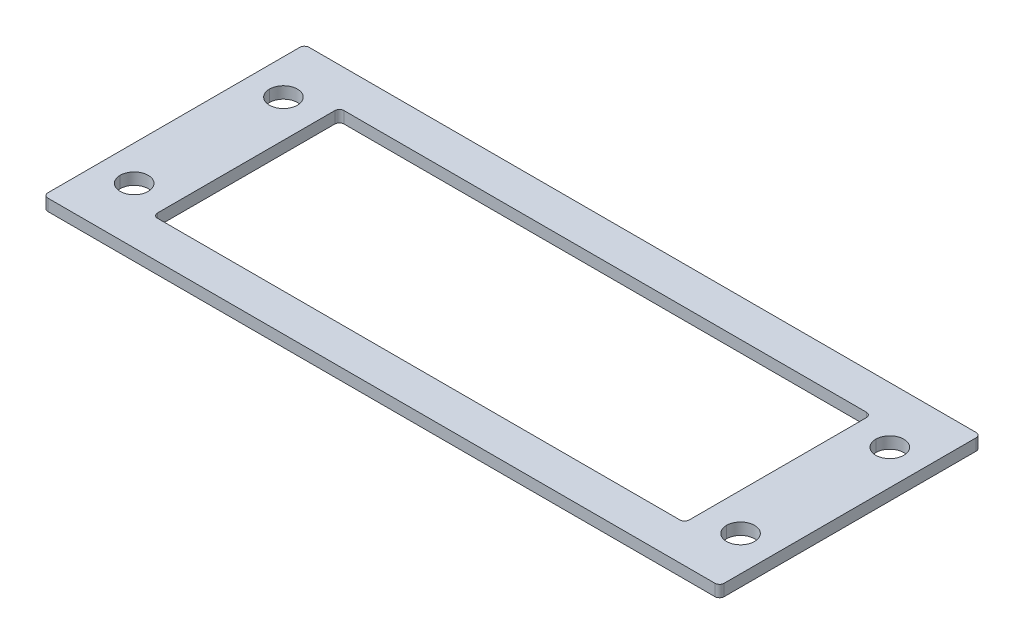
ISO-10303-21;
HEADER;
FILE_DESCRIPTION(('STEP AP214'),'2;1');
FILE_NAME('part.step','',(''),(''),'','','');
FILE_SCHEMA(('AUTOMOTIVE_DESIGN { 1 0 10303 214 1 1 1 1 }'));
ENDSEC;
DATA;
#1=APPLICATION_CONTEXT('core data for automotive mechanical design processes');
#2=APPLICATION_PROTOCOL_DEFINITION('international standard','automotive_design',2000,#1);
#3=PRODUCT_CONTEXT('',#1,'mechanical');
#4=PRODUCT('Part','Part','',(#3));
#5=PRODUCT_RELATED_PRODUCT_CATEGORY('part','',(#4));
#6=PRODUCT_DEFINITION_FORMATION('','',#4);
#7=PRODUCT_DEFINITION_CONTEXT('part definition',#1,'design');
#8=PRODUCT_DEFINITION('design','',#6,#7);
#9=PRODUCT_DEFINITION_SHAPE('','',#8);
#10=(LENGTH_UNIT() NAMED_UNIT(*) SI_UNIT(.MILLI.,.METRE.));
#11=(NAMED_UNIT(*) PLANE_ANGLE_UNIT() SI_UNIT($,.RADIAN.));
#12=(NAMED_UNIT(*) SI_UNIT($,.STERADIAN.) SOLID_ANGLE_UNIT());
#13=UNCERTAINTY_MEASURE_WITH_UNIT(LENGTH_MEASURE(1.E-05),#10,'distance_accuracy_value','');
#14=(GEOMETRIC_REPRESENTATION_CONTEXT(3) GLOBAL_UNCERTAINTY_ASSIGNED_CONTEXT((#13)) GLOBAL_UNIT_ASSIGNED_CONTEXT((#10,
#11,#12)) REPRESENTATION_CONTEXT('',''));
#15=CARTESIAN_POINT('',(0.,0.,0.));
#16=DIRECTION('',(0.,0.,1.));
#17=DIRECTION('',(1.,0.,0.));
#18=AXIS2_PLACEMENT_3D('',#15,#16,#17);
#19=CARTESIAN_POINT('',(65.,-10.9852813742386,-35.75));
#20=DIRECTION('',(0.,1.,0.));
#21=DIRECTION('',(-1.,0.,0.));
#22=AXIS2_PLACEMENT_3D('',#19,#20,#21);
#23=CYLINDRICAL_SURFACE('',#22,3.);
#24=DIRECTION('',(0.,1.,0.));
#25=VECTOR('',#24,1.);
#26=CARTESIAN_POINT('',(68.,-10.9852813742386,-35.75));
#27=LINE('',#26,#25);
#28=CARTESIAN_POINT('',(68.,-2.5,-35.75));
#29=VERTEX_POINT('',#28);
#30=CARTESIAN_POINT('',(68.,0.,-35.75));
#31=VERTEX_POINT('',#30);
#32=EDGE_CURVE('E240',#29,#31,#27,.T.);
#33=ORIENTED_EDGE('',*,*,#32,.F.);
#34=CARTESIAN_POINT('',(65.,-2.5,-35.75));
#35=DIRECTION('',(0.,1.,0.));
#36=DIRECTION('',(-1.,0.,0.));
#37=AXIS2_PLACEMENT_3D('',#34,#35,#36);
#38=CIRCLE('',#37,3.);
#39=CARTESIAN_POINT('',(62.,-2.5,-35.75));
#40=VERTEX_POINT('',#39);
#41=EDGE_CURVE('E226',#40,#29,#38,.T.);
#42=ORIENTED_EDGE('',*,*,#41,.F.);
#43=DIRECTION('',(0.,1.,0.));
#44=VECTOR('',#43,1.);
#45=CARTESIAN_POINT('',(62.,-10.9852813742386,-35.75));
#46=LINE('',#45,#44);
#47=CARTESIAN_POINT('',(62.,0.,-35.75));
#48=VERTEX_POINT('',#47);
#49=EDGE_CURVE('E249',#40,#48,#46,.T.);
#50=ORIENTED_EDGE('',*,*,#49,.T.);
#51=CARTESIAN_POINT('',(65.,0.,-35.75));
#52=DIRECTION('',(0.,-1.,0.));
#53=DIRECTION('',(1.,0.,0.));
#54=AXIS2_PLACEMENT_3D('',#51,#52,#53);
#55=CIRCLE('',#54,3.);
#56=EDGE_CURVE('E241',#31,#48,#55,.T.);
#57=ORIENTED_EDGE('',*,*,#56,.F.);
#58=EDGE_LOOP('',(#33,#42,#50,#57));
#59=FACE_BOUND('',#58,.T.);
#60=ADVANCED_FACE('F15',(#59),#23,.F.);
#61=CARTESIAN_POINT('',(-65.,-10.9852813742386,-35.75));
#62=DIRECTION('',(0.,1.,0.));
#63=DIRECTION('',(-1.,0.,0.));
#64=AXIS2_PLACEMENT_3D('',#61,#62,#63);
#65=CYLINDRICAL_SURFACE('',#64,3.);
#66=DIRECTION('',(0.,1.,0.));
#67=VECTOR('',#66,1.);
#68=CARTESIAN_POINT('',(-62.,-10.9852813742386,-35.75));
#69=LINE('',#68,#67);
#70=CARTESIAN_POINT('',(-62.,-2.5,-35.75));
#71=VERTEX_POINT('',#70);
#72=CARTESIAN_POINT('',(-62.,0.,-35.75));
#73=VERTEX_POINT('',#72);
#74=EDGE_CURVE('E285',#71,#73,#69,.T.);
#75=ORIENTED_EDGE('',*,*,#74,.F.);
#76=CARTESIAN_POINT('',(-65.,-2.5,-35.75));
#77=DIRECTION('',(0.,1.,0.));
#78=DIRECTION('',(-1.,0.,0.));
#79=AXIS2_PLACEMENT_3D('',#76,#77,#78);
#80=CIRCLE('',#79,3.);
#81=CARTESIAN_POINT('',(-68.,-2.5,-35.75));
#82=VERTEX_POINT('',#81);
#83=EDGE_CURVE('E237',#82,#71,#80,.T.);
#84=ORIENTED_EDGE('',*,*,#83,.F.);
#85=DIRECTION('',(0.,1.,0.));
#86=VECTOR('',#85,1.);
#87=CARTESIAN_POINT('',(-68.,-10.9852813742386,-35.75));
#88=LINE('',#87,#86);
#89=CARTESIAN_POINT('',(-68.,0.,-35.75));
#90=VERTEX_POINT('',#89);
#91=EDGE_CURVE('E303',#82,#90,#88,.T.);
#92=ORIENTED_EDGE('',*,*,#91,.T.);
#93=CARTESIAN_POINT('',(-65.,0.,-35.75));
#94=DIRECTION('',(0.,-1.,0.));
#95=DIRECTION('',(1.,0.,0.));
#96=AXIS2_PLACEMENT_3D('',#93,#94,#95);
#97=CIRCLE('',#96,3.);
#98=EDGE_CURVE('E442',#73,#90,#97,.T.);
#99=ORIENTED_EDGE('',*,*,#98,.F.);
#100=EDGE_LOOP('',(#75,#84,#92,#99));
#101=FACE_BOUND('',#100,.T.);
#102=ADVANCED_FACE('F538',(#101),#65,.F.);
#103=CARTESIAN_POINT('',(71.5,-2.5,-24.75));
#104=DIRECTION('',(0.,1.,0.));
#105=DIRECTION('',(-1.,0.,0.));
#106=AXIS2_PLACEMENT_3D('',#103,#104,#105);
#107=CYLINDRICAL_SURFACE('',#106,1.);
#108=CARTESIAN_POINT('',(71.5,-2.5,-24.75));
#109=DIRECTION('',(0.,-1.,0.));
#110=DIRECTION('',(-1.,0.,0.));
#111=AXIS2_PLACEMENT_3D('',#108,#109,#110);
#112=CIRCLE('',#111,1.);
#113=CARTESIAN_POINT('',(72.5,-2.5,-24.75));
#114=VERTEX_POINT('',#113);
#115=CARTESIAN_POINT('',(71.5,-2.5,-23.75));
#116=VERTEX_POINT('',#115);
#117=EDGE_CURVE('E360',#114,#116,#112,.T.);
#118=ORIENTED_EDGE('',*,*,#117,.F.);
#119=DIRECTION('',(0.,-1.,0.));
#120=VECTOR('',#119,1.);
#121=CARTESIAN_POINT('',(72.5,-2.5,-24.75));
#122=LINE('',#121,#120);
#123=CARTESIAN_POINT('',(72.5,0.,-24.75));
#124=VERTEX_POINT('',#123);
#125=EDGE_CURVE('E268',#124,#114,#122,.T.);
#126=ORIENTED_EDGE('',*,*,#125,.F.);
#127=CARTESIAN_POINT('',(71.5,0.,-24.75));
#128=DIRECTION('',(0.,1.,0.));
#129=DIRECTION('',(-1.,0.,0.));
#130=AXIS2_PLACEMENT_3D('',#127,#128,#129);
#131=CIRCLE('',#130,1.);
#132=CARTESIAN_POINT('',(71.5,0.,-23.75));
#133=VERTEX_POINT('',#132);
#134=EDGE_CURVE('E315',#133,#124,#131,.T.);
#135=ORIENTED_EDGE('',*,*,#134,.F.);
#136=DIRECTION('',(0.,1.,0.));
#137=VECTOR('',#136,1.);
#138=CARTESIAN_POINT('',(71.5,-2.5,-23.75));
#139=LINE('',#138,#137);
#140=EDGE_CURVE('E340',#116,#133,#139,.T.);
#141=ORIENTED_EDGE('',*,*,#140,.F.);
#142=EDGE_LOOP('',(#118,#126,#135,#141));
#143=FACE_BOUND('',#142,.T.);
#144=ADVANCED_FACE('F542',(#143),#107,.T.);
#145=CARTESIAN_POINT('',(71.5,-2.5,-78.75));
#146=DIRECTION('',(0.,1.,0.));
#147=DIRECTION('',(-1.,0.,0.));
#148=AXIS2_PLACEMENT_3D('',#145,#146,#147);
#149=CYLINDRICAL_SURFACE('',#148,1.);
#150=CARTESIAN_POINT('',(71.5,-2.5,-78.75));
#151=DIRECTION('',(0.,-1.,0.));
#152=DIRECTION('',(-1.,0.,0.));
#153=AXIS2_PLACEMENT_3D('',#150,#151,#152);
#154=CIRCLE('',#153,1.);
#155=CARTESIAN_POINT('',(71.5,-2.5,-79.75));
#156=VERTEX_POINT('',#155);
#157=CARTESIAN_POINT('',(72.5,-2.5,-78.75));
#158=VERTEX_POINT('',#157);
#159=EDGE_CURVE('E352',#156,#158,#154,.T.);
#160=ORIENTED_EDGE('',*,*,#159,.F.);
#161=DIRECTION('',(0.,-1.,0.));
#162=VECTOR('',#161,1.);
#163=CARTESIAN_POINT('',(71.5,-2.5,-79.75));
#164=LINE('',#163,#162);
#165=CARTESIAN_POINT('',(71.5,0.,-79.75));
#166=VERTEX_POINT('',#165);
#167=EDGE_CURVE('E269',#166,#156,#164,.T.);
#168=ORIENTED_EDGE('',*,*,#167,.F.);
#169=CARTESIAN_POINT('',(71.5,0.,-78.75));
#170=DIRECTION('',(0.,1.,0.));
#171=DIRECTION('',(-1.,0.,0.));
#172=AXIS2_PLACEMENT_3D('',#169,#170,#171);
#173=CIRCLE('',#172,1.);
#174=CARTESIAN_POINT('',(72.5,0.,-78.75));
#175=VERTEX_POINT('',#174);
#176=EDGE_CURVE('E430',#175,#166,#173,.T.);
#177=ORIENTED_EDGE('',*,*,#176,.F.);
#178=DIRECTION('',(0.,1.,0.));
#179=VECTOR('',#178,1.);
#180=CARTESIAN_POINT('',(72.5,-2.5,-78.75));
#181=LINE('',#180,#179);
#182=EDGE_CURVE('E265',#158,#175,#181,.T.);
#183=ORIENTED_EDGE('',*,*,#182,.F.);
#184=EDGE_LOOP('',(#160,#168,#177,#183));
#185=FACE_BOUND('',#184,.T.);
#186=ADVANCED_FACE('F547',(#185),#149,.T.);
#187=CARTESIAN_POINT('',(-71.5,-2.5,-78.75));
#188=DIRECTION('',(0.,1.,0.));
#189=DIRECTION('',(-1.,0.,0.));
#190=AXIS2_PLACEMENT_3D('',#187,#188,#189);
#191=CYLINDRICAL_SURFACE('',#190,1.);
#192=CARTESIAN_POINT('',(-71.5,-2.5,-78.75));
#193=DIRECTION('',(0.,-1.,0.));
#194=DIRECTION('',(-1.,0.,0.));
#195=AXIS2_PLACEMENT_3D('',#192,#193,#194);
#196=CIRCLE('',#195,1.);
#197=CARTESIAN_POINT('',(-72.5,-2.5,-78.75));
#198=VERTEX_POINT('',#197);
#199=CARTESIAN_POINT('',(-71.5,-2.5,-79.75));
#200=VERTEX_POINT('',#199);
#201=EDGE_CURVE('E344',#198,#200,#196,.T.);
#202=ORIENTED_EDGE('',*,*,#201,.F.);
#203=DIRECTION('',(0.,-1.,0.));
#204=VECTOR('',#203,1.);
#205=CARTESIAN_POINT('',(-72.5,-2.5,-78.75));
#206=LINE('',#205,#204);
#207=CARTESIAN_POINT('',(-72.5,0.,-78.75));
#208=VERTEX_POINT('',#207);
#209=EDGE_CURVE('E482',#208,#198,#206,.T.);
#210=ORIENTED_EDGE('',*,*,#209,.F.);
#211=CARTESIAN_POINT('',(-71.5,0.,-78.75));
#212=DIRECTION('',(0.,1.,0.));
#213=DIRECTION('',(-1.,0.,0.));
#214=AXIS2_PLACEMENT_3D('',#211,#212,#213);
#215=CIRCLE('',#214,1.);
#216=CARTESIAN_POINT('',(-71.5,0.,-79.75));
#217=VERTEX_POINT('',#216);
#218=EDGE_CURVE('E438',#217,#208,#215,.T.);
#219=ORIENTED_EDGE('',*,*,#218,.F.);
#220=DIRECTION('',(0.,1.,0.));
#221=VECTOR('',#220,1.);
#222=CARTESIAN_POINT('',(-71.5,-2.5,-79.75));
#223=LINE('',#222,#221);
#224=EDGE_CURVE('E371',#200,#217,#223,.T.);
#225=ORIENTED_EDGE('',*,*,#224,.F.);
#226=EDGE_LOOP('',(#202,#210,#219,#225));
#227=FACE_BOUND('',#226,.T.);
#228=ADVANCED_FACE('F554',(#227),#191,.T.);
#229=CARTESIAN_POINT('',(-71.5,-2.5,-24.75));
#230=DIRECTION('',(0.,1.,0.));
#231=DIRECTION('',(-1.,0.,0.));
#232=AXIS2_PLACEMENT_3D('',#229,#230,#231);
#233=CYLINDRICAL_SURFACE('',#232,1.);
#234=CARTESIAN_POINT('',(-71.5,-2.5,-24.75));
#235=DIRECTION('',(0.,-1.,0.));
#236=DIRECTION('',(-1.,0.,0.));
#237=AXIS2_PLACEMENT_3D('',#234,#235,#236);
#238=CIRCLE('',#237,1.);
#239=CARTESIAN_POINT('',(-71.5,-2.5,-23.75));
#240=VERTEX_POINT('',#239);
#241=CARTESIAN_POINT('',(-72.5,-2.5,-24.75));
#242=VERTEX_POINT('',#241);
#243=EDGE_CURVE('E332',#240,#242,#238,.T.);
#244=ORIENTED_EDGE('',*,*,#243,.F.);
#245=DIRECTION('',(0.,-1.,0.));
#246=VECTOR('',#245,1.);
#247=CARTESIAN_POINT('',(-71.5,-2.5,-23.75));
#248=LINE('',#247,#246);
#249=CARTESIAN_POINT('',(-71.5,0.,-23.75));
#250=VERTEX_POINT('',#249);
#251=EDGE_CURVE('E337',#250,#240,#248,.T.);
#252=ORIENTED_EDGE('',*,*,#251,.F.);
#253=CARTESIAN_POINT('',(-71.5,0.,-24.75));
#254=DIRECTION('',(0.,1.,0.));
#255=DIRECTION('',(-1.,0.,0.));
#256=AXIS2_PLACEMENT_3D('',#253,#254,#255);
#257=CIRCLE('',#256,1.);
#258=CARTESIAN_POINT('',(-72.5,0.,-24.75));
#259=VERTEX_POINT('',#258);
#260=EDGE_CURVE('E299',#259,#250,#257,.T.);
#261=ORIENTED_EDGE('',*,*,#260,.F.);
#262=DIRECTION('',(0.,1.,0.));
#263=VECTOR('',#262,1.);
#264=CARTESIAN_POINT('',(-72.5,-2.5,-24.75));
#265=LINE('',#264,#263);
#266=EDGE_CURVE('E479',#242,#259,#265,.T.);
#267=ORIENTED_EDGE('',*,*,#266,.F.);
#268=EDGE_LOOP('',(#244,#252,#261,#267));
#269=FACE_BOUND('',#268,.T.);
#270=ADVANCED_FACE('F558',(#269),#233,.T.);
#271=CARTESIAN_POINT('',(-56.,-123.313906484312,-70.75));
#272=DIRECTION('',(0.,-1.,0.));
#273=DIRECTION('',(1.,0.,0.));
#274=AXIS2_PLACEMENT_3D('',#271,#272,#273);
#275=CYLINDRICAL_SURFACE('',#274,1.);
#276=CARTESIAN_POINT('',(-56.,-2.5,-70.75));
#277=DIRECTION('',(0.,1.,0.));
#278=DIRECTION('',(-1.,0.,0.));
#279=AXIS2_PLACEMENT_3D('',#276,#277,#278);
#280=CIRCLE('',#279,1.);
#281=CARTESIAN_POINT('',(-56.,-2.5,-71.75));
#282=VERTEX_POINT('',#281);
#283=CARTESIAN_POINT('',(-57.,-2.5,-70.75));
#284=VERTEX_POINT('',#283);
#285=EDGE_CURVE('E400',#282,#284,#280,.T.);
#286=ORIENTED_EDGE('',*,*,#285,.F.);
#287=DIRECTION('',(0.,-1.,0.));
#288=VECTOR('',#287,1.);
#289=CARTESIAN_POINT('',(-56.,-2.5,-71.75));
#290=LINE('',#289,#288);
#291=CARTESIAN_POINT('',(-56.,0.,-71.75));
#292=VERTEX_POINT('',#291);
#293=EDGE_CURVE('E257',#292,#282,#290,.T.);
#294=ORIENTED_EDGE('',*,*,#293,.F.);
#295=CARTESIAN_POINT('',(-56.,0.,-70.75));
#296=DIRECTION('',(0.,-1.,0.));
#297=DIRECTION('',(-1.,0.,0.));
#298=AXIS2_PLACEMENT_3D('',#295,#296,#297);
#299=CIRCLE('',#298,1.);
#300=CARTESIAN_POINT('',(-57.,0.,-70.75));
#301=VERTEX_POINT('',#300);
#302=EDGE_CURVE('E470',#301,#292,#299,.T.);
#303=ORIENTED_EDGE('',*,*,#302,.F.);
#304=DIRECTION('',(0.,1.,0.));
#305=VECTOR('',#304,1.);
#306=CARTESIAN_POINT('',(-57.,0.,-70.75));
#307=LINE('',#306,#305);
#308=EDGE_CURVE('E10',#284,#301,#307,.T.);
#309=ORIENTED_EDGE('',*,*,#308,.F.);
#310=EDGE_LOOP('',(#286,#294,#303,#309));
#311=FACE_BOUND('',#310,.T.);
#312=ADVANCED_FACE('F503',(#311),#275,.F.);
#313=CARTESIAN_POINT('',(-56.,-123.313906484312,-32.75));
#314=DIRECTION('',(0.,-1.,0.));
#315=DIRECTION('',(1.,0.,0.));
#316=AXIS2_PLACEMENT_3D('',#313,#314,#315);
#317=CYLINDRICAL_SURFACE('',#316,1.);
#318=CARTESIAN_POINT('',(-56.,-2.5,-32.75));
#319=DIRECTION('',(0.,1.,0.));
#320=DIRECTION('',(-1.,0.,0.));
#321=AXIS2_PLACEMENT_3D('',#318,#319,#320);
#322=CIRCLE('',#321,1.);
#323=CARTESIAN_POINT('',(-57.,-2.5,-32.75));
#324=VERTEX_POINT('',#323);
#325=CARTESIAN_POINT('',(-56.,-2.5,-31.75));
#326=VERTEX_POINT('',#325);
#327=EDGE_CURVE('E368',#324,#326,#322,.T.);
#328=ORIENTED_EDGE('',*,*,#327,.F.);
#329=DIRECTION('',(0.,-1.,0.));
#330=VECTOR('',#329,1.);
#331=CARTESIAN_POINT('',(-57.,-2.5,-32.75));
#332=LINE('',#331,#330);
#333=CARTESIAN_POINT('',(-57.,0.,-32.75));
#334=VERTEX_POINT('',#333);
#335=EDGE_CURVE('E23',#334,#324,#332,.T.);
#336=ORIENTED_EDGE('',*,*,#335,.F.);
#337=CARTESIAN_POINT('',(-56.,0.,-32.75));
#338=DIRECTION('',(0.,-1.,0.));
#339=DIRECTION('',(-1.,0.,0.));
#340=AXIS2_PLACEMENT_3D('',#337,#338,#339);
#341=CIRCLE('',#340,1.);
#342=CARTESIAN_POINT('',(-56.,0.,-31.75));
#343=VERTEX_POINT('',#342);
#344=EDGE_CURVE('E462',#343,#334,#341,.T.);
#345=ORIENTED_EDGE('',*,*,#344,.F.);
#346=DIRECTION('',(0.,1.,0.));
#347=VECTOR('',#346,1.);
#348=CARTESIAN_POINT('',(-56.,0.,-31.75));
#349=LINE('',#348,#347);
#350=EDGE_CURVE('E489',#326,#343,#349,.T.);
#351=ORIENTED_EDGE('',*,*,#350,.F.);
#352=EDGE_LOOP('',(#328,#336,#345,#351));
#353=FACE_BOUND('',#352,.T.);
#354=ADVANCED_FACE('F496',(#353),#317,.F.);
#355=CARTESIAN_POINT('',(56.,-123.313906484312,-32.75));
#356=DIRECTION('',(0.,-1.,0.));
#357=DIRECTION('',(1.,0.,0.));
#358=AXIS2_PLACEMENT_3D('',#355,#356,#357);
#359=CYLINDRICAL_SURFACE('',#358,1.);
#360=CARTESIAN_POINT('',(56.,-2.5,-32.75));
#361=DIRECTION('',(0.,1.,0.));
#362=DIRECTION('',(-1.,0.,0.));
#363=AXIS2_PLACEMENT_3D('',#360,#361,#362);
#364=CIRCLE('',#363,1.);
#365=CARTESIAN_POINT('',(56.,-2.5,-31.75));
#366=VERTEX_POINT('',#365);
#367=CARTESIAN_POINT('',(57.,-2.5,-32.75));
#368=VERTEX_POINT('',#367);
#369=EDGE_CURVE('E379',#366,#368,#364,.T.);
#370=ORIENTED_EDGE('',*,*,#369,.F.);
#371=DIRECTION('',(0.,-1.,0.));
#372=VECTOR('',#371,1.);
#373=CARTESIAN_POINT('',(56.,-2.5,-31.75));
#374=LINE('',#373,#372);
#375=CARTESIAN_POINT('',(56.,0.,-31.75));
#376=VERTEX_POINT('',#375);
#377=EDGE_CURVE('E392',#376,#366,#374,.T.);
#378=ORIENTED_EDGE('',*,*,#377,.F.);
#379=CARTESIAN_POINT('',(56.,0.,-32.75));
#380=DIRECTION('',(0.,-1.,0.));
#381=DIRECTION('',(-1.,0.,0.));
#382=AXIS2_PLACEMENT_3D('',#379,#380,#381);
#383=CIRCLE('',#382,1.);
#384=CARTESIAN_POINT('',(57.,0.,-32.75));
#385=VERTEX_POINT('',#384);
#386=EDGE_CURVE('E401',#385,#376,#383,.T.);
#387=ORIENTED_EDGE('',*,*,#386,.F.);
#388=DIRECTION('',(0.,1.,0.));
#389=VECTOR('',#388,1.);
#390=CARTESIAN_POINT('',(57.,0.,-32.75));
#391=LINE('',#390,#389);
#392=EDGE_CURVE('E258',#368,#385,#391,.T.);
#393=ORIENTED_EDGE('',*,*,#392,.F.);
#394=EDGE_LOOP('',(#370,#378,#387,#393));
#395=FACE_BOUND('',#394,.T.);
#396=ADVANCED_FACE('F515',(#395),#359,.F.);
#397=CARTESIAN_POINT('',(56.,-123.313906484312,-70.75));
#398=DIRECTION('',(0.,-1.,0.));
#399=DIRECTION('',(1.,0.,0.));
#400=AXIS2_PLACEMENT_3D('',#397,#398,#399);
#401=CYLINDRICAL_SURFACE('',#400,1.);
#402=CARTESIAN_POINT('',(56.,-2.5,-70.75));
#403=DIRECTION('',(0.,1.,0.));
#404=DIRECTION('',(-1.,0.,0.));
#405=AXIS2_PLACEMENT_3D('',#402,#403,#404);
#406=CIRCLE('',#405,1.);
#407=CARTESIAN_POINT('',(57.,-2.5,-70.75));
#408=VERTEX_POINT('',#407);
#409=CARTESIAN_POINT('',(56.,-2.5,-71.75));
#410=VERTEX_POINT('',#409);
#411=EDGE_CURVE('E389',#408,#410,#406,.T.);
#412=ORIENTED_EDGE('',*,*,#411,.F.);
#413=DIRECTION('',(0.,-1.,0.));
#414=VECTOR('',#413,1.);
#415=CARTESIAN_POINT('',(57.,-2.5,-70.75));
#416=LINE('',#415,#414);
#417=CARTESIAN_POINT('',(57.,0.,-70.75));
#418=VERTEX_POINT('',#417);
#419=EDGE_CURVE('E415',#418,#408,#416,.T.);
#420=ORIENTED_EDGE('',*,*,#419,.F.);
#421=CARTESIAN_POINT('',(56.,0.,-70.75));
#422=DIRECTION('',(0.,-1.,0.));
#423=DIRECTION('',(-1.,0.,0.));
#424=AXIS2_PLACEMENT_3D('',#421,#422,#423);
#425=CIRCLE('',#424,1.);
#426=CARTESIAN_POINT('',(56.,0.,-71.75));
#427=VERTEX_POINT('',#426);
#428=EDGE_CURVE('E452',#427,#418,#425,.T.);
#429=ORIENTED_EDGE('',*,*,#428,.F.);
#430=DIRECTION('',(0.,1.,0.));
#431=VECTOR('',#430,1.);
#432=CARTESIAN_POINT('',(56.,0.,-71.75));
#433=LINE('',#432,#431);
#434=EDGE_CURVE('E254',#410,#427,#433,.T.);
#435=ORIENTED_EDGE('',*,*,#434,.F.);
#436=EDGE_LOOP('',(#412,#420,#429,#435));
#437=FACE_BOUND('',#436,.T.);
#438=ADVANCED_FACE('F522',(#437),#401,.F.);
#439=CARTESIAN_POINT('',(65.,-123.313906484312,-67.75));
#440=DIRECTION('',(0.,1.,0.));
#441=DIRECTION('',(-1.,0.,0.));
#442=AXIS2_PLACEMENT_3D('',#439,#440,#441);
#443=CYLINDRICAL_SURFACE('',#442,3.);
#444=DIRECTION('',(0.,1.,0.));
#445=VECTOR('',#444,1.);
#446=CARTESIAN_POINT('',(68.,-123.313906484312,-67.75));
#447=LINE('',#446,#445);
#448=CARTESIAN_POINT('',(68.,-2.5,-67.75));
#449=VERTEX_POINT('',#448);
#450=CARTESIAN_POINT('',(68.,0.,-67.75));
#451=VERTEX_POINT('',#450);
#452=EDGE_CURVE('E259',#449,#451,#447,.T.);
#453=ORIENTED_EDGE('',*,*,#452,.F.);
#454=CARTESIAN_POINT('',(65.,-2.5,-67.75));
#455=DIRECTION('',(0.,1.,0.));
#456=DIRECTION('',(-1.,0.,0.));
#457=AXIS2_PLACEMENT_3D('',#454,#455,#456);
#458=CIRCLE('',#457,3.);
#459=CARTESIAN_POINT('',(62.,-2.5,-67.75));
#460=VERTEX_POINT('',#459);
#461=EDGE_CURVE('E281',#460,#449,#458,.T.);
#462=ORIENTED_EDGE('',*,*,#461,.F.);
#463=DIRECTION('',(0.,1.,0.));
#464=VECTOR('',#463,1.);
#465=CARTESIAN_POINT('',(62.,-123.313906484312,-67.75));
#466=LINE('',#465,#464);
#467=CARTESIAN_POINT('',(62.,0.,-67.75));
#468=VERTEX_POINT('',#467);
#469=EDGE_CURVE('E275',#460,#468,#466,.T.);
#470=ORIENTED_EDGE('',*,*,#469,.T.);
#471=CARTESIAN_POINT('',(65.,0.,-67.75));
#472=DIRECTION('',(0.,-1.,0.));
#473=DIRECTION('',(1.,0.,0.));
#474=AXIS2_PLACEMENT_3D('',#471,#472,#473);
#475=CIRCLE('',#474,3.);
#476=EDGE_CURVE('E474',#451,#468,#475,.T.);
#477=ORIENTED_EDGE('',*,*,#476,.F.);
#478=EDGE_LOOP('',(#453,#462,#470,#477));
#479=FACE_BOUND('',#478,.T.);
#480=ADVANCED_FACE('F571',(#479),#443,.F.);
#481=CARTESIAN_POINT('',(-65.,-123.313906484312,-67.75));
#482=DIRECTION('',(0.,1.,0.));
#483=DIRECTION('',(-1.,0.,0.));
#484=AXIS2_PLACEMENT_3D('',#481,#482,#483);
#485=CYLINDRICAL_SURFACE('',#484,3.);
#486=DIRECTION('',(0.,1.,0.));
#487=VECTOR('',#486,1.);
#488=CARTESIAN_POINT('',(-62.,-123.313906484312,-67.75));
#489=LINE('',#488,#487);
#490=CARTESIAN_POINT('',(-62.,-2.5,-67.75));
#491=VERTEX_POINT('',#490);
#492=CARTESIAN_POINT('',(-62.,0.,-67.75));
#493=VERTEX_POINT('',#492);
#494=EDGE_CURVE('E290',#491,#493,#489,.T.);
#495=ORIENTED_EDGE('',*,*,#494,.F.);
#496=CARTESIAN_POINT('',(-65.,-2.5,-67.75));
#497=DIRECTION('',(0.,1.,0.));
#498=DIRECTION('',(-1.,0.,0.));
#499=AXIS2_PLACEMENT_3D('',#496,#497,#498);
#500=CIRCLE('',#499,3.);
#501=CARTESIAN_POINT('',(-68.,-2.5,-67.75));
#502=VERTEX_POINT('',#501);
#503=EDGE_CURVE('E410',#502,#491,#500,.T.);
#504=ORIENTED_EDGE('',*,*,#503,.F.);
#505=DIRECTION('',(0.,1.,0.));
#506=VECTOR('',#505,1.);
#507=CARTESIAN_POINT('',(-68.,-123.313906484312,-67.75));
#508=LINE('',#507,#506);
#509=CARTESIAN_POINT('',(-68.,0.,-67.75));
#510=VERTEX_POINT('',#509);
#511=EDGE_CURVE('E307',#502,#510,#508,.T.);
#512=ORIENTED_EDGE('',*,*,#511,.T.);
#513=CARTESIAN_POINT('',(-65.,0.,-67.75));
#514=DIRECTION('',(0.,-1.,0.));
#515=DIRECTION('',(1.,0.,0.));
#516=AXIS2_PLACEMENT_3D('',#513,#514,#515);
#517=CIRCLE('',#516,3.);
#518=EDGE_CURVE('E445',#493,#510,#517,.T.);
#519=ORIENTED_EDGE('',*,*,#518,.F.);
#520=EDGE_LOOP('',(#495,#504,#512,#519));
#521=FACE_BOUND('',#520,.T.);
#522=ADVANCED_FACE('F533',(#521),#485,.F.);
#523=CARTESIAN_POINT('',(-57.,-123.313906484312,-71.75));
#524=DIRECTION('',(1.,0.,0.));
#525=DIRECTION('',(0.,0.,1.));
#526=AXIS2_PLACEMENT_3D('',#523,#524,#525);
#527=PLANE('',#526);
#528=DIRECTION('',(0.,0.,-1.));
#529=VECTOR('',#528,1.);
#530=CARTESIAN_POINT('',(-57.,0.,-71.75));
#531=LINE('',#530,#529);
#532=EDGE_CURVE('E466',#334,#301,#531,.T.);
#533=ORIENTED_EDGE('',*,*,#532,.F.);
#534=ORIENTED_EDGE('',*,*,#335,.T.);
#535=DIRECTION('',(0.,0.,1.));
#536=VECTOR('',#535,1.);
#537=CARTESIAN_POINT('',(-57.,-2.5,-71.75));
#538=LINE('',#537,#536);
#539=EDGE_CURVE('E364',#284,#324,#538,.T.);
#540=ORIENTED_EDGE('',*,*,#539,.F.);
#541=ORIENTED_EDGE('',*,*,#308,.T.);
#542=EDGE_LOOP('',(#533,#534,#540,#541));
#543=FACE_BOUND('',#542,.T.);
#544=ADVANCED_FACE('F495',(#543),#527,.T.);
#545=CARTESIAN_POINT('',(-57.,-123.313906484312,-71.75));
#546=DIRECTION('',(0.,0.,1.));
#547=DIRECTION('',(1.,0.,0.));
#548=AXIS2_PLACEMENT_3D('',#545,#546,#547);
#549=PLANE('',#548);
#550=DIRECTION('',(-1.,0.,0.));
#551=VECTOR('',#550,1.);
#552=CARTESIAN_POINT('',(-57.,-2.5,-71.75));
#553=LINE('',#552,#551);
#554=EDGE_CURVE('E396',#410,#282,#553,.T.);
#555=ORIENTED_EDGE('',*,*,#554,.F.);
#556=ORIENTED_EDGE('',*,*,#434,.T.);
#557=DIRECTION('',(1.,0.,0.));
#558=VECTOR('',#557,1.);
#559=CARTESIAN_POINT('',(-57.,0.,-71.75));
#560=LINE('',#559,#558);
#561=EDGE_CURVE('E448',#292,#427,#560,.T.);
#562=ORIENTED_EDGE('',*,*,#561,.F.);
#563=ORIENTED_EDGE('',*,*,#293,.T.);
#564=EDGE_LOOP('',(#555,#556,#562,#563));
#565=FACE_BOUND('',#564,.T.);
#566=ADVANCED_FACE('F524',(#565),#549,.T.);
#567=CARTESIAN_POINT('',(57.,-123.313906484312,-71.75));
#568=DIRECTION('',(-1.,0.,0.));
#569=DIRECTION('',(0.,-1.,0.));
#570=AXIS2_PLACEMENT_3D('',#567,#568,#569);
#571=PLANE('',#570);
#572=DIRECTION('',(0.,0.,1.));
#573=VECTOR('',#572,1.);
#574=CARTESIAN_POINT('',(57.,0.,-71.75));
#575=LINE('',#574,#573);
#576=EDGE_CURVE('E406',#418,#385,#575,.T.);
#577=ORIENTED_EDGE('',*,*,#576,.F.);
#578=ORIENTED_EDGE('',*,*,#419,.T.);
#579=DIRECTION('',(0.,0.,-1.));
#580=VECTOR('',#579,1.);
#581=CARTESIAN_POINT('',(57.,-2.5,-71.75));
#582=LINE('',#581,#580);
#583=EDGE_CURVE('E385',#368,#408,#582,.T.);
#584=ORIENTED_EDGE('',*,*,#583,.F.);
#585=ORIENTED_EDGE('',*,*,#392,.T.);
#586=EDGE_LOOP('',(#577,#578,#584,#585));
#587=FACE_BOUND('',#586,.T.);
#588=ADVANCED_FACE('F518',(#587),#571,.T.);
#589=CARTESIAN_POINT('',(-57.,-123.313906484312,-31.75));
#590=DIRECTION('',(0.,0.,-1.));
#591=DIRECTION('',(0.,1.,0.));
#592=AXIS2_PLACEMENT_3D('',#589,#590,#591);
#593=PLANE('',#592);
#594=DIRECTION('',(-1.,0.,0.));
#595=VECTOR('',#594,1.);
#596=CARTESIAN_POINT('',(-57.,0.,-31.75));
#597=LINE('',#596,#595);
#598=EDGE_CURVE('E405',#376,#343,#597,.T.);
#599=ORIENTED_EDGE('',*,*,#598,.F.);
#600=ORIENTED_EDGE('',*,*,#377,.T.);
#601=DIRECTION('',(1.,0.,0.));
#602=VECTOR('',#601,1.);
#603=CARTESIAN_POINT('',(-57.,-2.5,-31.75));
#604=LINE('',#603,#602);
#605=EDGE_CURVE('E375',#326,#366,#604,.T.);
#606=ORIENTED_EDGE('',*,*,#605,.F.);
#607=ORIENTED_EDGE('',*,*,#350,.T.);
#608=EDGE_LOOP('',(#599,#600,#606,#607));
#609=FACE_BOUND('',#608,.T.);
#610=ADVANCED_FACE('F511',(#609),#593,.T.);
#611=CARTESIAN_POINT('',(-72.5,-2.5,-23.75));
#612=DIRECTION('',(0.,0.,-1.));
#613=DIRECTION('',(0.,1.,0.));
#614=AXIS2_PLACEMENT_3D('',#611,#612,#613);
#615=PLANE('',#614);
#616=DIRECTION('',(-1.,0.,0.));
#617=VECTOR('',#616,1.);
#618=CARTESIAN_POINT('',(-72.5,0.,-23.75));
#619=LINE('',#618,#617);
#620=EDGE_CURVE('E311',#133,#250,#619,.T.);
#621=ORIENTED_EDGE('',*,*,#620,.T.);
#622=ORIENTED_EDGE('',*,*,#251,.T.);
#623=DIRECTION('',(-1.,0.,0.));
#624=VECTOR('',#623,1.);
#625=CARTESIAN_POINT('',(-72.5,-2.5,-23.75));
#626=LINE('',#625,#624);
#627=EDGE_CURVE('E328',#116,#240,#626,.T.);
#628=ORIENTED_EDGE('',*,*,#627,.F.);
#629=ORIENTED_EDGE('',*,*,#140,.T.);
#630=EDGE_LOOP('',(#621,#622,#628,#629));
#631=FACE_BOUND('',#630,.T.);
#632=ADVANCED_FACE('F581',(#631),#615,.F.);
#633=CARTESIAN_POINT('',(72.5,-2.5,-79.75));
#634=DIRECTION('',(-1.,0.,0.));
#635=DIRECTION('',(0.,-1.,0.));
#636=AXIS2_PLACEMENT_3D('',#633,#634,#635);
#637=PLANE('',#636);
#638=DIRECTION('',(0.,0.,1.));
#639=VECTOR('',#638,1.);
#640=CARTESIAN_POINT('',(72.5,-2.5,-79.75));
#641=LINE('',#640,#639);
#642=EDGE_CURVE('E356',#158,#114,#641,.T.);
#643=ORIENTED_EDGE('',*,*,#642,.F.);
#644=ORIENTED_EDGE('',*,*,#182,.T.);
#645=DIRECTION('',(0.,0.,1.));
#646=VECTOR('',#645,1.);
#647=CARTESIAN_POINT('',(72.5,0.,-79.75));
#648=LINE('',#647,#646);
#649=EDGE_CURVE('E426',#175,#124,#648,.T.);
#650=ORIENTED_EDGE('',*,*,#649,.T.);
#651=ORIENTED_EDGE('',*,*,#125,.T.);
#652=EDGE_LOOP('',(#643,#644,#650,#651));
#653=FACE_BOUND('',#652,.T.);
#654=ADVANCED_FACE('F579',(#653),#637,.F.);
#655=CARTESIAN_POINT('',(-72.5,-2.5,-79.75));
#656=DIRECTION('',(0.,0.,1.));
#657=DIRECTION('',(1.,0.,0.));
#658=AXIS2_PLACEMENT_3D('',#655,#656,#657);
#659=PLANE('',#658);
#660=DIRECTION('',(1.,0.,0.));
#661=VECTOR('',#660,1.);
#662=CARTESIAN_POINT('',(-72.5,-2.5,-79.75));
#663=LINE('',#662,#661);
#664=EDGE_CURVE('E348',#200,#156,#663,.T.);
#665=ORIENTED_EDGE('',*,*,#664,.F.);
#666=ORIENTED_EDGE('',*,*,#224,.T.);
#667=DIRECTION('',(1.,0.,0.));
#668=VECTOR('',#667,1.);
#669=CARTESIAN_POINT('',(-72.5,0.,-79.75));
#670=LINE('',#669,#668);
#671=EDGE_CURVE('E434',#217,#166,#670,.T.);
#672=ORIENTED_EDGE('',*,*,#671,.T.);
#673=ORIENTED_EDGE('',*,*,#167,.T.);
#674=EDGE_LOOP('',(#665,#666,#672,#673));
#675=FACE_BOUND('',#674,.T.);
#676=ADVANCED_FACE('F575',(#675),#659,.F.);
#677=CARTESIAN_POINT('',(-72.5,-2.5,-79.75));
#678=DIRECTION('',(1.,0.,0.));
#679=DIRECTION('',(0.,0.,1.));
#680=AXIS2_PLACEMENT_3D('',#677,#678,#679);
#681=PLANE('',#680);
#682=DIRECTION('',(0.,0.,-1.));
#683=VECTOR('',#682,1.);
#684=CARTESIAN_POINT('',(-72.5,-2.5,-79.75));
#685=LINE('',#684,#683);
#686=EDGE_CURVE('E336',#242,#198,#685,.T.);
#687=ORIENTED_EDGE('',*,*,#686,.F.);
#688=ORIENTED_EDGE('',*,*,#266,.T.);
#689=DIRECTION('',(0.,0.,-1.));
#690=VECTOR('',#689,1.);
#691=CARTESIAN_POINT('',(-72.5,0.,-79.75));
#692=LINE('',#691,#690);
#693=EDGE_CURVE('E236',#259,#208,#692,.T.);
#694=ORIENTED_EDGE('',*,*,#693,.T.);
#695=ORIENTED_EDGE('',*,*,#209,.T.);
#696=EDGE_LOOP('',(#687,#688,#694,#695));
#697=FACE_BOUND('',#696,.T.);
#698=ADVANCED_FACE('F578',(#697),#681,.F.);
#699=CARTESIAN_POINT('',(-72.5,0.,-23.75));
#700=DIRECTION('',(0.,1.,0.));
#701=DIRECTION('',(0.,0.,-1.));
#702=AXIS2_PLACEMENT_3D('',#699,#700,#701);
#703=PLANE('',#702);
#704=CARTESIAN_POINT('',(65.,0.,-35.75));
#705=DIRECTION('',(0.,-1.,0.));
#706=DIRECTION('',(1.,0.,0.));
#707=AXIS2_PLACEMENT_3D('',#704,#705,#706);
#708=CIRCLE('',#707,3.);
#709=EDGE_CURVE('E246',#48,#31,#708,.T.);
#710=ORIENTED_EDGE('',*,*,#709,.T.);
#711=ORIENTED_EDGE('',*,*,#56,.T.);
#712=EDGE_LOOP('',(#710,#711));
#713=FACE_BOUND('',#712,.T.);
#714=CARTESIAN_POINT('',(65.,0.,-67.75));
#715=DIRECTION('',(0.,-1.,0.));
#716=DIRECTION('',(1.,0.,0.));
#717=AXIS2_PLACEMENT_3D('',#714,#715,#716);
#718=CIRCLE('',#717,3.);
#719=EDGE_CURVE('E263',#468,#451,#718,.T.);
#720=ORIENTED_EDGE('',*,*,#719,.T.);
#721=ORIENTED_EDGE('',*,*,#476,.T.);
#722=EDGE_LOOP('',(#720,#721));
#723=FACE_BOUND('',#722,.T.);
#724=ORIENTED_EDGE('',*,*,#561,.T.);
#725=ORIENTED_EDGE('',*,*,#428,.T.);
#726=ORIENTED_EDGE('',*,*,#576,.T.);
#727=ORIENTED_EDGE('',*,*,#386,.T.);
#728=ORIENTED_EDGE('',*,*,#598,.T.);
#729=ORIENTED_EDGE('',*,*,#344,.T.);
#730=ORIENTED_EDGE('',*,*,#532,.T.);
#731=ORIENTED_EDGE('',*,*,#302,.T.);
#732=EDGE_LOOP('',(#724,#725,#726,#727,#728,#729,#730,#731));
#733=FACE_BOUND('',#732,.T.);
#734=CARTESIAN_POINT('',(-65.,0.,-67.75));
#735=DIRECTION('',(0.,-1.,0.));
#736=DIRECTION('',(1.,0.,0.));
#737=AXIS2_PLACEMENT_3D('',#734,#735,#736);
#738=CIRCLE('',#737,3.);
#739=EDGE_CURVE('E294',#510,#493,#738,.T.);
#740=ORIENTED_EDGE('',*,*,#739,.T.);
#741=ORIENTED_EDGE('',*,*,#518,.T.);
#742=EDGE_LOOP('',(#740,#741));
#743=FACE_BOUND('',#742,.T.);
#744=CARTESIAN_POINT('',(-65.,0.,-35.75));
#745=DIRECTION('',(0.,-1.,0.));
#746=DIRECTION('',(1.,0.,0.));
#747=AXIS2_PLACEMENT_3D('',#744,#745,#746);
#748=CIRCLE('',#747,3.);
#749=EDGE_CURVE('E289',#90,#73,#748,.T.);
#750=ORIENTED_EDGE('',*,*,#749,.T.);
#751=ORIENTED_EDGE('',*,*,#98,.T.);
#752=EDGE_LOOP('',(#750,#751));
#753=FACE_BOUND('',#752,.T.);
#754=ORIENTED_EDGE('',*,*,#693,.F.);
#755=ORIENTED_EDGE('',*,*,#260,.T.);
#756=ORIENTED_EDGE('',*,*,#620,.F.);
#757=ORIENTED_EDGE('',*,*,#134,.T.);
#758=ORIENTED_EDGE('',*,*,#649,.F.);
#759=ORIENTED_EDGE('',*,*,#176,.T.);
#760=ORIENTED_EDGE('',*,*,#671,.F.);
#761=ORIENTED_EDGE('',*,*,#218,.T.);
#762=EDGE_LOOP('',(#754,#755,#756,#757,#758,#759,#760,#761));
#763=FACE_BOUND('',#762,.T.);
#764=ADVANCED_FACE('F506',(#713,#723,#733,#743,#753,#763),#703,.T.);
#765=CARTESIAN_POINT('',(-72.5,-2.5,-23.75));
#766=DIRECTION('',(0.,1.,0.));
#767=DIRECTION('',(0.,0.,-1.));
#768=AXIS2_PLACEMENT_3D('',#765,#766,#767);
#769=PLANE('',#768);
#770=ORIENTED_EDGE('',*,*,#41,.T.);
#771=CARTESIAN_POINT('',(65.,-2.5,-35.75));
#772=DIRECTION('',(0.,1.,0.));
#773=DIRECTION('',(-1.,0.,0.));
#774=AXIS2_PLACEMENT_3D('',#771,#772,#773);
#775=CIRCLE('',#774,3.);
#776=EDGE_CURVE('E231',#29,#40,#775,.T.);
#777=ORIENTED_EDGE('',*,*,#776,.T.);
#778=EDGE_LOOP('',(#770,#777));
#779=FACE_BOUND('',#778,.T.);
#780=ORIENTED_EDGE('',*,*,#83,.T.);
#781=CARTESIAN_POINT('',(-65.,-2.5,-35.75));
#782=DIRECTION('',(0.,1.,0.));
#783=DIRECTION('',(-1.,0.,0.));
#784=AXIS2_PLACEMENT_3D('',#781,#782,#783);
#785=CIRCLE('',#784,3.);
#786=EDGE_CURVE('E278',#71,#82,#785,.T.);
#787=ORIENTED_EDGE('',*,*,#786,.T.);
#788=EDGE_LOOP('',(#780,#787));
#789=FACE_BOUND('',#788,.T.);
#790=ORIENTED_EDGE('',*,*,#461,.T.);
#791=CARTESIAN_POINT('',(65.,-2.5,-67.75));
#792=DIRECTION('',(0.,1.,0.));
#793=DIRECTION('',(-1.,0.,0.));
#794=AXIS2_PLACEMENT_3D('',#791,#792,#793);
#795=CIRCLE('',#794,3.);
#796=EDGE_CURVE('E264',#449,#460,#795,.T.);
#797=ORIENTED_EDGE('',*,*,#796,.T.);
#798=EDGE_LOOP('',(#790,#797));
#799=FACE_BOUND('',#798,.T.);
#800=ORIENTED_EDGE('',*,*,#503,.T.);
#801=CARTESIAN_POINT('',(-65.,-2.5,-67.75));
#802=DIRECTION('',(0.,1.,0.));
#803=DIRECTION('',(-1.,0.,0.));
#804=AXIS2_PLACEMENT_3D('',#801,#802,#803);
#805=CIRCLE('',#804,3.);
#806=EDGE_CURVE('E295',#491,#502,#805,.T.);
#807=ORIENTED_EDGE('',*,*,#806,.T.);
#808=EDGE_LOOP('',(#800,#807));
#809=FACE_BOUND('',#808,.T.);
#810=ORIENTED_EDGE('',*,*,#539,.T.);
#811=ORIENTED_EDGE('',*,*,#327,.T.);
#812=ORIENTED_EDGE('',*,*,#605,.T.);
#813=ORIENTED_EDGE('',*,*,#369,.T.);
#814=ORIENTED_EDGE('',*,*,#583,.T.);
#815=ORIENTED_EDGE('',*,*,#411,.T.);
#816=ORIENTED_EDGE('',*,*,#554,.T.);
#817=ORIENTED_EDGE('',*,*,#285,.T.);
#818=EDGE_LOOP('',(#810,#811,#812,#813,#814,#815,#816,#817));
#819=FACE_BOUND('',#818,.T.);
#820=ORIENTED_EDGE('',*,*,#627,.T.);
#821=ORIENTED_EDGE('',*,*,#243,.T.);
#822=ORIENTED_EDGE('',*,*,#686,.T.);
#823=ORIENTED_EDGE('',*,*,#201,.T.);
#824=ORIENTED_EDGE('',*,*,#664,.T.);
#825=ORIENTED_EDGE('',*,*,#159,.T.);
#826=ORIENTED_EDGE('',*,*,#642,.T.);
#827=ORIENTED_EDGE('',*,*,#117,.T.);
#828=EDGE_LOOP('',(#820,#821,#822,#823,#824,#825,#826,#827));
#829=FACE_BOUND('',#828,.T.);
#830=ADVANCED_FACE('F228',(#779,#789,#799,#809,#819,#829),#769,.F.);
#831=CARTESIAN_POINT('',(-65.,-123.313906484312,-67.75));
#832=DIRECTION('',(0.,1.,0.));
#833=DIRECTION('',(-1.,0.,0.));
#834=AXIS2_PLACEMENT_3D('',#831,#832,#833);
#835=CYLINDRICAL_SURFACE('',#834,3.);
#836=ORIENTED_EDGE('',*,*,#806,.F.);
#837=ORIENTED_EDGE('',*,*,#494,.T.);
#838=ORIENTED_EDGE('',*,*,#739,.F.);
#839=ORIENTED_EDGE('',*,*,#511,.F.);
#840=EDGE_LOOP('',(#836,#837,#838,#839));
#841=FACE_BOUND('',#840,.T.);
#842=ADVANCED_FACE('F626',(#841),#835,.F.);
#843=CARTESIAN_POINT('',(65.,-123.313906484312,-67.75));
#844=DIRECTION('',(0.,1.,0.));
#845=DIRECTION('',(-1.,0.,0.));
#846=AXIS2_PLACEMENT_3D('',#843,#844,#845);
#847=CYLINDRICAL_SURFACE('',#846,3.);
#848=ORIENTED_EDGE('',*,*,#796,.F.);
#849=ORIENTED_EDGE('',*,*,#452,.T.);
#850=ORIENTED_EDGE('',*,*,#719,.F.);
#851=ORIENTED_EDGE('',*,*,#469,.F.);
#852=EDGE_LOOP('',(#848,#849,#850,#851));
#853=FACE_BOUND('',#852,.T.);
#854=ADVANCED_FACE('F633',(#853),#847,.F.);
#855=CARTESIAN_POINT('',(-65.,-10.9852813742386,-35.75));
#856=DIRECTION('',(0.,1.,0.));
#857=DIRECTION('',(-1.,0.,0.));
#858=AXIS2_PLACEMENT_3D('',#855,#856,#857);
#859=CYLINDRICAL_SURFACE('',#858,3.);
#860=ORIENTED_EDGE('',*,*,#786,.F.);
#861=ORIENTED_EDGE('',*,*,#74,.T.);
#862=ORIENTED_EDGE('',*,*,#749,.F.);
#863=ORIENTED_EDGE('',*,*,#91,.F.);
#864=EDGE_LOOP('',(#860,#861,#862,#863));
#865=FACE_BOUND('',#864,.T.);
#866=ADVANCED_FACE('F641',(#865),#859,.F.);
#867=CARTESIAN_POINT('',(65.,-10.9852813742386,-35.75));
#868=DIRECTION('',(0.,1.,0.));
#869=DIRECTION('',(-1.,0.,0.));
#870=AXIS2_PLACEMENT_3D('',#867,#868,#869);
#871=CYLINDRICAL_SURFACE('',#870,3.);
#872=ORIENTED_EDGE('',*,*,#776,.F.);
#873=ORIENTED_EDGE('',*,*,#32,.T.);
#874=ORIENTED_EDGE('',*,*,#709,.F.);
#875=ORIENTED_EDGE('',*,*,#49,.F.);
#876=EDGE_LOOP('',(#872,#873,#874,#875));
#877=FACE_BOUND('',#876,.T.);
#878=ADVANCED_FACE('F248',(#877),#871,.F.);
#879=CLOSED_SHELL('',(#60,#102,#144,#186,#228,#270,#312,#354,#396,#438,#480,#522,#544,#566,#588,
#610,#632,#654,#676,#698,#764,#830,#842,#854,#866,#878));
#880=MANIFOLD_SOLID_BREP('B1',#879);
#881=ADVANCED_BREP_SHAPE_REPRESENTATION('',(#18,#880),#14);
#882=SHAPE_DEFINITION_REPRESENTATION(#9,#881);
ENDSEC;
END-ISO-10303-21;
